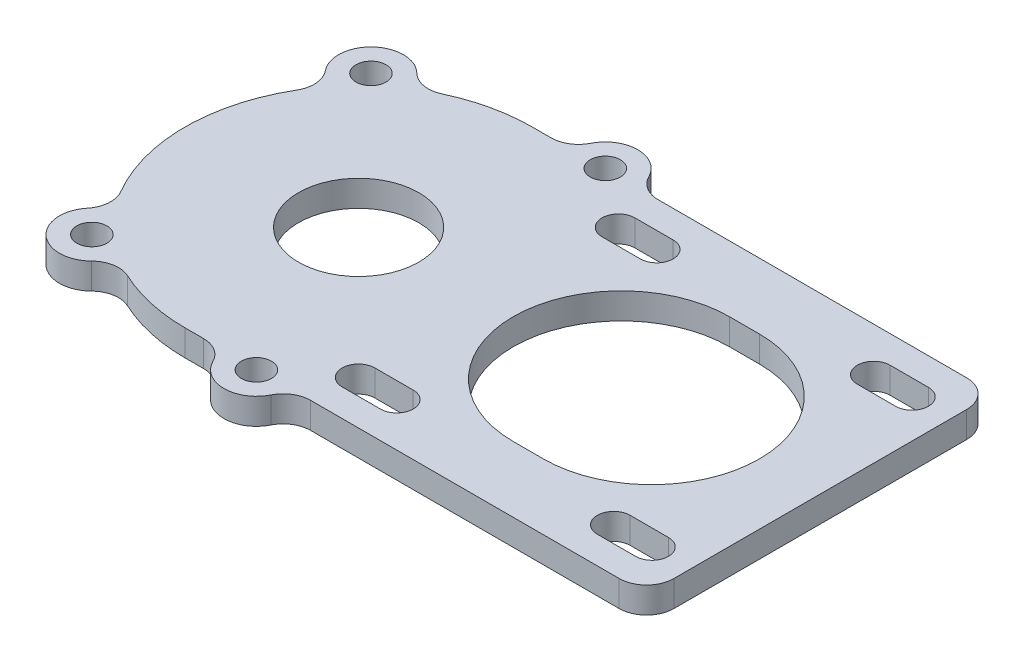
from build123d import *

# Parameters (mm, degrees)
SKETCH1_R           = 11
SKETCH1_R_2         = 2.75
BOSS_EXTRUDE2_DEPTH = 4.7625
FILLET1_R           = 5


with BuildPart() as part:
    # Sketch1 → Boss-Extrude2 (new body)
    with BuildSketch(Plane(origin=(0, 0, 0), x_dir=(1, 0, 0), z_dir=(0, 1, 0))):
        with BuildLine():
            Line((-27.2125, -31.75), (-19.936394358, -31.75))
            ThreePointArc((-19.936394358, -31.75), (-14.01271307, -37.8), (-8.089031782, -31.75))
            Line((-8.089031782, -31.75), (57.15, -31.75))
            Line((57.15, -31.75), (57.15, 31.75))
            Line((57.15, 31.75), (-8.089031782, 31.75))
            ThreePointArc((-8.089031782, 31.75), (-14.01271307, 37.8), (-19.936394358, 31.75))
            Line((-19.936394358, 31.75), (-27.2125, 31.75))
            ThreePointArc((-27.2125, 31.75), (-36.295738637, 30.422972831), (-44.619688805, 26.552820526))
            ThreePointArc((-44.619688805, 26.552820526), (-54.44125683, 29.879347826), (-52.038779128, 19.791876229))
            ThreePointArc((-52.038779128, 19.791876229), (-58.9625, 0), (-52.038779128, -19.791876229))
            ThreePointArc((-52.038779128, -19.791876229), (-54.44125683, -29.879347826), (-44.619688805, -26.552820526))
            ThreePointArc((-44.619688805, -26.552820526), (-36.295738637, -30.422972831), (-27.2125, -31.75))
        make_face()
        with Locations(Location((-27.2125, 0, 0), (0, 0, 90))):
            Circle(SKETCH1_R, mode=Mode.SUBTRACT)
        with Locations(Location((-14.01271307, -31.875, 0), (0, 0, 90))):
            Circle(SKETCH1_R_2, mode=Mode.SUBTRACT)
        with Locations(Location((-14.01271307, 31.875, 0), (0, 0, 90))):
            Circle(SKETCH1_R_2, mode=Mode.SUBTRACT)
        with Locations(Location((-50.450400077, 25.5, 0), (0, 0, 90))):
            Circle(SKETCH1_R_2, mode=Mode.SUBTRACT)
        with Locations(Location((-50.450400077, -25.5, 0), (0, 0, 90))):
            Circle(SKETCH1_R_2, mode=Mode.SUBTRACT)
        with BuildLine():
            Line((26.2875, -19.75), (20.7875, -19.75))
            ThreePointArc((20.7875, -19.75), (1.0375, 0), (20.7875, 19.75))
            Line((20.7875, 19.75), (26.2875, 19.75))
            ThreePointArc((26.2875, 19.75), (46.0375, 0), (26.2875, -19.75))
        make_face(mode=Mode.SUBTRACT)
        with BuildLine():
            Line((50.15, 20.75), (43.15, 20.75))
            ThreePointArc((43.15, 20.75), (40.15, 23.75), (43.15, 26.75))
            Line((43.15, 26.75), (50.15, 26.75))
            ThreePointArc((50.15, 26.75), (53.15, 23.75), (50.15, 20.75))
        make_face(mode=Mode.SUBTRACT)
        with BuildLine():
            Line((50.15, -20.75), (43.15, -20.75))
            ThreePointArc((43.15, -20.75), (40.15, -23.75), (43.15, -26.75))
            Line((43.15, -26.75), (50.15, -26.75))
            ThreePointArc((50.15, -26.75), (53.15, -23.75), (50.15, -20.75))
        make_face(mode=Mode.SUBTRACT)
        with BuildLine():
            Line((3.518583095, 20.75), (-3.481416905, 20.75))
            ThreePointArc((-3.481416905, 20.75), (-6.481416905, 23.75), (-3.481416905, 26.75))
            Line((-3.481416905, 26.75), (3.518583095, 26.75))
            ThreePointArc((3.518583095, 26.75), (6.518583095, 23.75), (3.518583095, 20.75))
        make_face(mode=Mode.SUBTRACT)
        with BuildLine():
            Line((3.518583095, -20.75), (-3.481416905, -20.75))
            ThreePointArc((-3.481416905, -20.75), (-6.481416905, -23.75), (-3.481416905, -26.75))
            Line((-3.481416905, -26.75), (3.518583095, -26.75))
            ThreePointArc((3.518583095, -26.75), (6.518583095, -23.75), (3.518583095, -20.75))
        make_face(mode=Mode.SUBTRACT)
    extrude(amount=BOSS_EXTRUDE2_DEPTH)

    # Fillet1
    fillet1_edges = [part.edges().sort_by_distance(p)[0] for p in [
        (57.15, 2.38125, -31.75),
        (57.15, 2.38125, 31.75),
        (-8.089031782, 2.38125, 31.75),
        (-19.936394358, 2.38125, 31.75),
        (-44.619688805, 2.38125, 26.552820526),
        (-52.038779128, 2.38125, 19.791876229),
        (-52.038779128, 2.38125, -19.791876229),
        (-44.619688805, 2.38125, -26.552820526),
        (-19.936394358, 2.38125, -31.75),
        (-8.089031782, 2.38125, -31.75),
    ]]
    fillet(fillet1_edges, radius=FILLET1_R)


solid = part.part
